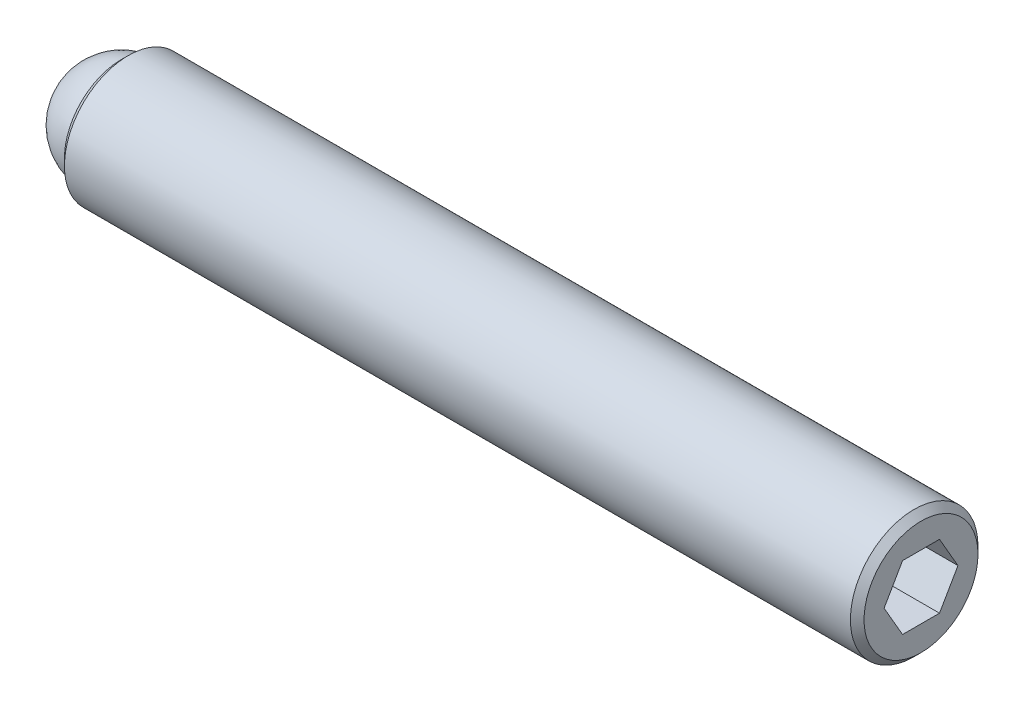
ISO-10303-21;
HEADER;
FILE_DESCRIPTION(('STEP AP214'),'2;1');
FILE_NAME('part.step','',(''),(''),'','','');
FILE_SCHEMA(('AUTOMOTIVE_DESIGN { 1 0 10303 214 1 1 1 1 }'));
ENDSEC;
DATA;
#1=APPLICATION_CONTEXT('core data for automotive mechanical design processes');
#2=APPLICATION_PROTOCOL_DEFINITION('international standard','automotive_design',2000,#1);
#3=PRODUCT_CONTEXT('',#1,'mechanical');
#4=PRODUCT('Part','Part','',(#3));
#5=PRODUCT_RELATED_PRODUCT_CATEGORY('part','',(#4));
#6=PRODUCT_DEFINITION_FORMATION('','',#4);
#7=PRODUCT_DEFINITION_CONTEXT('part definition',#1,'design');
#8=PRODUCT_DEFINITION('design','',#6,#7);
#9=PRODUCT_DEFINITION_SHAPE('','',#8);
#10=(LENGTH_UNIT() NAMED_UNIT(*) SI_UNIT(.MILLI.,.METRE.));
#11=(NAMED_UNIT(*) PLANE_ANGLE_UNIT() SI_UNIT($,.RADIAN.));
#12=(NAMED_UNIT(*) SI_UNIT($,.STERADIAN.) SOLID_ANGLE_UNIT());
#13=UNCERTAINTY_MEASURE_WITH_UNIT(LENGTH_MEASURE(1.E-05),#10,'distance_accuracy_value','');
#14=(GEOMETRIC_REPRESENTATION_CONTEXT(3) GLOBAL_UNCERTAINTY_ASSIGNED_CONTEXT((#13)) GLOBAL_UNIT_ASSIGNED_CONTEXT((#10,
#11,#12)) REPRESENTATION_CONTEXT('',''));
#15=CARTESIAN_POINT('',(0.,0.,0.));
#16=DIRECTION('',(0.,0.,1.));
#17=DIRECTION('',(1.,0.,0.));
#18=AXIS2_PLACEMENT_3D('',#15,#16,#17);
#19=CARTESIAN_POINT('',(0.,0.,0.));
#20=DIRECTION('',(0.,-1.,0.));
#21=DIRECTION('',(0.,0.,1.));
#22=AXIS2_PLACEMENT_3D('',#19,#20,#21);
#23=SPHERICAL_SURFACE('',#22,1.984375);
#24=CARTESIAN_POINT('',(0.,-1.984375,0.));
#25=VERTEX_POINT('',#24);
#26=VERTEX_LOOP('',#25);
#27=FACE_BOUND('',#26,.T.);
#28=ADVANCED_FACE('F41',(#27),#23,.T.);
#29=CLOSED_SHELL('',(#28));
#30=MANIFOLD_SOLID_BREP('B2',#29);
#31=CARTESIAN_POINT('',(29.765625,0.,0.));
#32=DIRECTION('',(-1.,0.,0.));
#33=DIRECTION('',(0.,0.,1.));
#34=AXIS2_PLACEMENT_3D('',#31,#32,#33);
#35=CYLINDRICAL_SURFACE('',#34,2.3749);
#36=CARTESIAN_POINT('',(29.511625,0.,0.));
#37=DIRECTION('',(1.,0.,0.));
#38=DIRECTION('',(0.,0.,-1.));
#39=AXIS2_PLACEMENT_3D('',#36,#37,#38);
#40=CIRCLE('',#39,2.3749);
#41=CARTESIAN_POINT('',(29.511625,0.,-2.3749));
#42=VERTEX_POINT('',#41);
#43=EDGE_CURVE('E39',#42,#42,#40,.F.);
#44=ORIENTED_EDGE('',*,*,#43,.T.);
#45=EDGE_LOOP('',(#44));
#46=FACE_BOUND('',#45,.T.);
#47=CARTESIAN_POINT('',(0.254000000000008,0.,0.));
#48=DIRECTION('',(1.,0.,0.));
#49=DIRECTION('',(0.,0.,-1.));
#50=AXIS2_PLACEMENT_3D('',#47,#48,#49);
#51=CIRCLE('',#50,2.3749);
#52=CARTESIAN_POINT('',(0.254000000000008,0.,-2.3749));
#53=VERTEX_POINT('',#52);
#54=EDGE_CURVE('E157',#53,#53,#51,.T.);
#55=ORIENTED_EDGE('',*,*,#54,.T.);
#56=EDGE_LOOP('',(#55));
#57=FACE_BOUND('',#56,.T.);
#58=ADVANCED_FACE('F54',(#46,#57),#35,.T.);
#59=CARTESIAN_POINT('',(29.765625,0.,0.));
#60=DIRECTION('',(1.,0.,0.));
#61=DIRECTION('',(0.,0.,-1.));
#62=AXIS2_PLACEMENT_3D('',#59,#60,#61);
#63=PLANE('',#62);
#64=DIRECTION('',(0.,0.866025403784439,-0.5));
#65=VECTOR('',#64,1.);
#66=CARTESIAN_POINT('',(29.765625,-1.190625,-0.687407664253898));
#67=LINE('',#66,#65);
#68=CARTESIAN_POINT('',(29.765625,-1.190625,-0.687407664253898));
#69=VERTEX_POINT('',#68);
#70=CARTESIAN_POINT('',(29.765625,0.,-1.3748153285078));
#71=VERTEX_POINT('',#70);
#72=EDGE_CURVE('E69',#69,#71,#67,.T.);
#73=ORIENTED_EDGE('',*,*,#72,.F.);
#74=DIRECTION('',(0.,0.,-1.));
#75=VECTOR('',#74,1.);
#76=CARTESIAN_POINT('',(29.765625,-1.190625,0.687407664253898));
#77=LINE('',#76,#75);
#78=CARTESIAN_POINT('',(29.765625,-1.190625,0.687407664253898));
#79=VERTEX_POINT('',#78);
#80=EDGE_CURVE('E153',#79,#69,#77,.T.);
#81=ORIENTED_EDGE('',*,*,#80,.F.);
#82=DIRECTION('',(0.,-0.866025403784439,-0.5));
#83=VECTOR('',#82,1.);
#84=CARTESIAN_POINT('',(29.765625,0.,1.3748153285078));
#85=LINE('',#84,#83);
#86=CARTESIAN_POINT('',(29.765625,0.,1.3748153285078));
#87=VERTEX_POINT('',#86);
#88=EDGE_CURVE('E151',#87,#79,#85,.T.);
#89=ORIENTED_EDGE('',*,*,#88,.F.);
#90=DIRECTION('',(0.,-0.866025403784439,0.5));
#91=VECTOR('',#90,1.);
#92=CARTESIAN_POINT('',(29.765625,1.190625,0.687407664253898));
#93=LINE('',#92,#91);
#94=CARTESIAN_POINT('',(29.765625,1.190625,0.687407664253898));
#95=VERTEX_POINT('',#94);
#96=EDGE_CURVE('E117',#95,#87,#93,.T.);
#97=ORIENTED_EDGE('',*,*,#96,.F.);
#98=DIRECTION('',(0.,0.,1.));
#99=VECTOR('',#98,1.);
#100=CARTESIAN_POINT('',(29.765625,1.190625,-0.687407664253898));
#101=LINE('',#100,#99);
#102=CARTESIAN_POINT('',(29.765625,1.190625,-0.687407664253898));
#103=VERTEX_POINT('',#102);
#104=EDGE_CURVE('E147',#103,#95,#101,.T.);
#105=ORIENTED_EDGE('',*,*,#104,.F.);
#106=DIRECTION('',(0.,0.866025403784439,0.5));
#107=VECTOR('',#106,1.);
#108=CARTESIAN_POINT('',(29.765625,0.,-1.3748153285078));
#109=LINE('',#108,#107);
#110=EDGE_CURVE('E143',#71,#103,#109,.T.);
#111=ORIENTED_EDGE('',*,*,#110,.F.);
#112=EDGE_LOOP('',(#73,#81,#89,#97,#105,#111));
#113=FACE_BOUND('',#112,.T.);
#114=CARTESIAN_POINT('',(29.765625,0.,0.));
#115=DIRECTION('',(1.,0.,0.));
#116=DIRECTION('',(0.,0.,-1.));
#117=AXIS2_PLACEMENT_3D('',#114,#115,#116);
#118=CIRCLE('',#117,2.1209);
#119=CARTESIAN_POINT('',(29.765625,0.,-2.1209));
#120=VERTEX_POINT('',#119);
#121=EDGE_CURVE('E62',#120,#120,#118,.T.);
#122=ORIENTED_EDGE('',*,*,#121,.T.);
#123=EDGE_LOOP('',(#122));
#124=FACE_BOUND('',#123,.T.);
#125=ADVANCED_FACE('F170',(#113,#124),#63,.T.);
#126=CARTESIAN_POINT('',(0.,0.,0.));
#127=DIRECTION('',(1.,0.,0.));
#128=DIRECTION('',(0.,0.,-1.));
#129=AXIS2_PLACEMENT_3D('',#126,#127,#128);
#130=PLANE('',#129);
#131=CARTESIAN_POINT('',(0.,0.,0.));
#132=DIRECTION('',(-1.,0.,0.));
#133=DIRECTION('',(0.,0.,1.));
#134=AXIS2_PLACEMENT_3D('',#131,#132,#133);
#135=CIRCLE('',#134,1.9812);
#136=CARTESIAN_POINT('',(0.,0.,1.9812));
#137=VERTEX_POINT('',#136);
#138=EDGE_CURVE('E225',#137,#137,#135,.T.);
#139=ORIENTED_EDGE('',*,*,#138,.F.);
#140=EDGE_LOOP('',(#139));
#141=FACE_BOUND('',#140,.T.);
#142=CARTESIAN_POINT('',(0.,0.,0.));
#143=DIRECTION('',(1.,0.,0.));
#144=DIRECTION('',(0.,0.,-1.));
#145=AXIS2_PLACEMENT_3D('',#142,#143,#144);
#146=CIRCLE('',#145,2.12089999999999);
#147=CARTESIAN_POINT('',(0.,0.,-2.12089999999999));
#148=VERTEX_POINT('',#147);
#149=EDGE_CURVE('E165',#148,#148,#146,.F.);
#150=ORIENTED_EDGE('',*,*,#149,.T.);
#151=EDGE_LOOP('',(#150));
#152=FACE_BOUND('',#151,.T.);
#153=ADVANCED_FACE('F182',(#141,#152),#130,.F.);
#154=CARTESIAN_POINT('',(0.254000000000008,0.,0.));
#155=DIRECTION('',(1.,0.,0.));
#156=DIRECTION('',(0.,0.,-1.));
#157=AXIS2_PLACEMENT_3D('',#154,#155,#156);
#158=CONICAL_SURFACE('',#157,2.3749,0.785398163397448);
#159=ORIENTED_EDGE('',*,*,#149,.F.);
#160=EDGE_LOOP('',(#159));
#161=FACE_BOUND('',#160,.T.);
#162=ORIENTED_EDGE('',*,*,#54,.F.);
#163=EDGE_LOOP('',(#162));
#164=FACE_BOUND('',#163,.T.);
#165=ADVANCED_FACE('F174',(#161,#164),#158,.T.);
#166=CARTESIAN_POINT('',(29.765625,0.,0.));
#167=DIRECTION('',(-1.,0.,0.));
#168=DIRECTION('',(0.,0.,1.));
#169=AXIS2_PLACEMENT_3D('',#166,#167,#168);
#170=CONICAL_SURFACE('',#169,2.1209,0.785398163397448);
#171=ORIENTED_EDGE('',*,*,#43,.F.);
#172=EDGE_LOOP('',(#171));
#173=FACE_BOUND('',#172,.T.);
#174=ORIENTED_EDGE('',*,*,#121,.F.);
#175=EDGE_LOOP('',(#174));
#176=FACE_BOUND('',#175,.T.);
#177=ADVANCED_FACE('F56',(#173,#176),#170,.T.);
#178=CARTESIAN_POINT('',(27.479625,-1.190625,-0.687407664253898));
#179=DIRECTION('',(0.,-0.5,-0.866025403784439));
#180=DIRECTION('',(0.,0.866025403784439,-0.5));
#181=AXIS2_PLACEMENT_3D('',#178,#179,#180);
#182=PLANE('',#181);
#183=ORIENTED_EDGE('',*,*,#72,.T.);
#184=DIRECTION('',(1.,0.,0.));
#185=VECTOR('',#184,1.);
#186=CARTESIAN_POINT('',(27.479625,0.,-1.3748153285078));
#187=LINE('',#186,#185);
#188=CARTESIAN_POINT('',(27.479625,0.,-1.3748153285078));
#189=VERTEX_POINT('',#188);
#190=EDGE_CURVE('E99',#189,#71,#187,.T.);
#191=ORIENTED_EDGE('',*,*,#190,.F.);
#192=DIRECTION('',(0.,0.866025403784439,-0.5));
#193=VECTOR('',#192,1.);
#194=CARTESIAN_POINT('',(27.479625,-1.190625,-0.687407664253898));
#195=LINE('',#194,#193);
#196=CARTESIAN_POINT('',(27.479625,-1.190625,-0.687407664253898));
#197=VERTEX_POINT('',#196);
#198=EDGE_CURVE('E155',#197,#189,#195,.T.);
#199=ORIENTED_EDGE('',*,*,#198,.F.);
#200=DIRECTION('',(1.,0.,0.));
#201=VECTOR('',#200,1.);
#202=CARTESIAN_POINT('',(27.479625,-1.190625,-0.687407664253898));
#203=LINE('',#202,#201);
#204=EDGE_CURVE('E77',#197,#69,#203,.T.);
#205=ORIENTED_EDGE('',*,*,#204,.T.);
#206=EDGE_LOOP('',(#183,#191,#199,#205));
#207=FACE_BOUND('',#206,.T.);
#208=ADVANCED_FACE('F173',(#207),#182,.F.);
#209=CARTESIAN_POINT('',(27.479625,-1.190625,0.687407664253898));
#210=DIRECTION('',(0.,-1.,0.));
#211=DIRECTION('',(0.,0.,-1.));
#212=AXIS2_PLACEMENT_3D('',#209,#210,#211);
#213=PLANE('',#212);
#214=ORIENTED_EDGE('',*,*,#80,.T.);
#215=ORIENTED_EDGE('',*,*,#204,.F.);
#216=DIRECTION('',(0.,0.,-1.));
#217=VECTOR('',#216,1.);
#218=CARTESIAN_POINT('',(27.479625,-1.190625,0.687407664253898));
#219=LINE('',#218,#217);
#220=CARTESIAN_POINT('',(27.479625,-1.190625,0.687407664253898));
#221=VERTEX_POINT('',#220);
#222=EDGE_CURVE('E129',#221,#197,#219,.T.);
#223=ORIENTED_EDGE('',*,*,#222,.F.);
#224=DIRECTION('',(1.,0.,0.));
#225=VECTOR('',#224,1.);
#226=CARTESIAN_POINT('',(27.479625,-1.190625,0.687407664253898));
#227=LINE('',#226,#225);
#228=EDGE_CURVE('E121',#221,#79,#227,.T.);
#229=ORIENTED_EDGE('',*,*,#228,.T.);
#230=EDGE_LOOP('',(#214,#215,#223,#229));
#231=FACE_BOUND('',#230,.T.);
#232=ADVANCED_FACE('F180',(#231),#213,.F.);
#233=CARTESIAN_POINT('',(27.479625,0.,1.3748153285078));
#234=DIRECTION('',(0.,-0.5,0.866025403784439));
#235=DIRECTION('',(0.,-0.866025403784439,-0.5));
#236=AXIS2_PLACEMENT_3D('',#233,#234,#235);
#237=PLANE('',#236);
#238=ORIENTED_EDGE('',*,*,#88,.T.);
#239=ORIENTED_EDGE('',*,*,#228,.F.);
#240=DIRECTION('',(0.,-0.866025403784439,-0.5));
#241=VECTOR('',#240,1.);
#242=CARTESIAN_POINT('',(27.479625,0.,1.3748153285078));
#243=LINE('',#242,#241);
#244=CARTESIAN_POINT('',(27.479625,0.,1.3748153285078));
#245=VERTEX_POINT('',#244);
#246=EDGE_CURVE('E125',#245,#221,#243,.T.);
#247=ORIENTED_EDGE('',*,*,#246,.F.);
#248=DIRECTION('',(1.,0.,0.));
#249=VECTOR('',#248,1.);
#250=CARTESIAN_POINT('',(27.479625,0.,1.3748153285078));
#251=LINE('',#250,#249);
#252=EDGE_CURVE('E110',#245,#87,#251,.T.);
#253=ORIENTED_EDGE('',*,*,#252,.T.);
#254=EDGE_LOOP('',(#238,#239,#247,#253));
#255=FACE_BOUND('',#254,.T.);
#256=ADVANCED_FACE('F126',(#255),#237,.F.);
#257=CARTESIAN_POINT('',(27.479625,1.190625,0.687407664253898));
#258=DIRECTION('',(0.,0.5,0.866025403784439));
#259=DIRECTION('',(0.,-0.866025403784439,0.5));
#260=AXIS2_PLACEMENT_3D('',#257,#258,#259);
#261=PLANE('',#260);
#262=ORIENTED_EDGE('',*,*,#96,.T.);
#263=ORIENTED_EDGE('',*,*,#252,.F.);
#264=DIRECTION('',(0.,-0.866025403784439,0.5));
#265=VECTOR('',#264,1.);
#266=CARTESIAN_POINT('',(27.479625,1.190625,0.687407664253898));
#267=LINE('',#266,#265);
#268=CARTESIAN_POINT('',(27.479625,1.190625,0.687407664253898));
#269=VERTEX_POINT('',#268);
#270=EDGE_CURVE('E114',#269,#245,#267,.T.);
#271=ORIENTED_EDGE('',*,*,#270,.F.);
#272=DIRECTION('',(1.,0.,0.));
#273=VECTOR('',#272,1.);
#274=CARTESIAN_POINT('',(27.479625,1.190625,0.687407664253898));
#275=LINE('',#274,#273);
#276=EDGE_CURVE('E122',#269,#95,#275,.T.);
#277=ORIENTED_EDGE('',*,*,#276,.T.);
#278=EDGE_LOOP('',(#262,#263,#271,#277));
#279=FACE_BOUND('',#278,.T.);
#280=ADVANCED_FACE('F112',(#279),#261,.F.);
#281=CARTESIAN_POINT('',(27.479625,1.190625,-0.687407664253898));
#282=DIRECTION('',(0.,1.,0.));
#283=DIRECTION('',(0.,0.,1.));
#284=AXIS2_PLACEMENT_3D('',#281,#282,#283);
#285=PLANE('',#284);
#286=ORIENTED_EDGE('',*,*,#104,.T.);
#287=ORIENTED_EDGE('',*,*,#276,.F.);
#288=DIRECTION('',(0.,0.,1.));
#289=VECTOR('',#288,1.);
#290=CARTESIAN_POINT('',(27.479625,1.190625,-0.687407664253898));
#291=LINE('',#290,#289);
#292=CARTESIAN_POINT('',(27.479625,1.190625,-0.687407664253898));
#293=VERTEX_POINT('',#292);
#294=EDGE_CURVE('E135',#293,#269,#291,.T.);
#295=ORIENTED_EDGE('',*,*,#294,.F.);
#296=DIRECTION('',(1.,0.,0.));
#297=VECTOR('',#296,1.);
#298=CARTESIAN_POINT('',(27.479625,1.190625,-0.687407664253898));
#299=LINE('',#298,#297);
#300=EDGE_CURVE('E160',#293,#103,#299,.T.);
#301=ORIENTED_EDGE('',*,*,#300,.T.);
#302=EDGE_LOOP('',(#286,#287,#295,#301));
#303=FACE_BOUND('',#302,.T.);
#304=ADVANCED_FACE('F201',(#303),#285,.F.);
#305=CARTESIAN_POINT('',(27.479625,0.,-1.3748153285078));
#306=DIRECTION('',(0.,0.5,-0.866025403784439));
#307=DIRECTION('',(0.,0.866025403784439,0.5));
#308=AXIS2_PLACEMENT_3D('',#305,#306,#307);
#309=PLANE('',#308);
#310=ORIENTED_EDGE('',*,*,#110,.T.);
#311=ORIENTED_EDGE('',*,*,#300,.F.);
#312=DIRECTION('',(0.,0.866025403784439,0.5));
#313=VECTOR('',#312,1.);
#314=CARTESIAN_POINT('',(27.479625,0.,-1.3748153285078));
#315=LINE('',#314,#313);
#316=EDGE_CURVE('E137',#189,#293,#315,.T.);
#317=ORIENTED_EDGE('',*,*,#316,.F.);
#318=ORIENTED_EDGE('',*,*,#190,.T.);
#319=EDGE_LOOP('',(#310,#311,#317,#318));
#320=FACE_BOUND('',#319,.T.);
#321=ADVANCED_FACE('F198',(#320),#309,.F.);
#322=CARTESIAN_POINT('',(27.479625,0.,0.));
#323=DIRECTION('',(1.,0.,0.));
#324=DIRECTION('',(0.,0.,-1.));
#325=AXIS2_PLACEMENT_3D('',#322,#323,#324);
#326=PLANE('',#325);
#327=ORIENTED_EDGE('',*,*,#198,.T.);
#328=ORIENTED_EDGE('',*,*,#316,.T.);
#329=ORIENTED_EDGE('',*,*,#294,.T.);
#330=ORIENTED_EDGE('',*,*,#270,.T.);
#331=ORIENTED_EDGE('',*,*,#246,.T.);
#332=ORIENTED_EDGE('',*,*,#222,.T.);
#333=EDGE_LOOP('',(#327,#328,#329,#330,#331,#332));
#334=FACE_BOUND('',#333,.T.);
#335=ADVANCED_FACE('F132',(#334),#326,.T.);
#336=CARTESIAN_POINT('',(1.984375,0.,0.));
#337=DIRECTION('',(-1.,0.,0.));
#338=DIRECTION('',(0.,0.,1.));
#339=AXIS2_PLACEMENT_3D('',#336,#337,#338);
#340=CYLINDRICAL_SURFACE('',#339,1.9812);
#341=CARTESIAN_POINT('',(1.984375,0.,0.));
#342=DIRECTION('',(-1.,0.,0.));
#343=DIRECTION('',(0.,0.,1.));
#344=AXIS2_PLACEMENT_3D('',#341,#342,#343);
#345=CIRCLE('',#344,1.9812);
#346=CARTESIAN_POINT('',(1.984375,0.,1.9812));
#347=VERTEX_POINT('',#346);
#348=EDGE_CURVE('E144',#347,#347,#345,.T.);
#349=ORIENTED_EDGE('',*,*,#348,.F.);
#350=EDGE_LOOP('',(#349));
#351=FACE_BOUND('',#350,.T.);
#352=ORIENTED_EDGE('',*,*,#138,.T.);
#353=EDGE_LOOP('',(#352));
#354=FACE_BOUND('',#353,.T.);
#355=ADVANCED_FACE('F214',(#351,#354),#340,.F.);
#356=CARTESIAN_POINT('',(1.984375,0.,0.));
#357=DIRECTION('',(-1.,0.,0.));
#358=DIRECTION('',(0.,0.,1.));
#359=AXIS2_PLACEMENT_3D('',#356,#357,#358);
#360=PLANE('',#359);
#361=ORIENTED_EDGE('',*,*,#348,.T.);
#362=EDGE_LOOP('',(#361));
#363=FACE_BOUND('',#362,.T.);
#364=ADVANCED_FACE('F217',(#363),#360,.T.);
#365=CLOSED_SHELL('',(#58,#125,#153,#165,#177,#208,#232,#256,#280,#304,#321,#335,#355,#364));
#366=MANIFOLD_SOLID_BREP('B6',#365);
#367=ADVANCED_BREP_SHAPE_REPRESENTATION('',(#18,#30,#366),#14);
#368=SHAPE_DEFINITION_REPRESENTATION(#9,#367);
ENDSEC;
END-ISO-10303-21;
